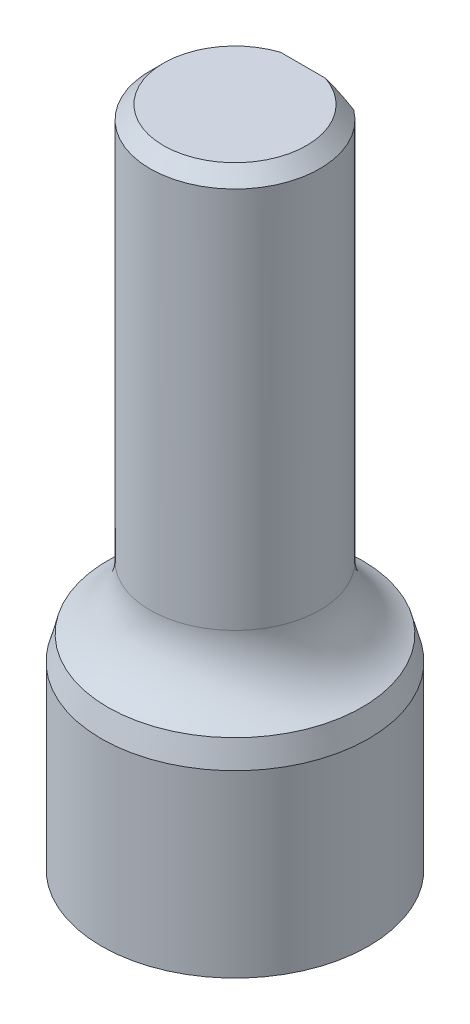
ISO-10303-21;
HEADER;
FILE_DESCRIPTION(('STEP AP214'),'2;1');
FILE_NAME('part.step','',(''),(''),'','','');
FILE_SCHEMA(('AUTOMOTIVE_DESIGN { 1 0 10303 214 1 1 1 1 }'));
ENDSEC;
DATA;
#1=APPLICATION_CONTEXT('core data for automotive mechanical design processes');
#2=APPLICATION_PROTOCOL_DEFINITION('international standard','automotive_design',2000,#1);
#3=PRODUCT_CONTEXT('',#1,'mechanical');
#4=PRODUCT('Part','Part','',(#3));
#5=PRODUCT_RELATED_PRODUCT_CATEGORY('part','',(#4));
#6=PRODUCT_DEFINITION_FORMATION('','',#4);
#7=PRODUCT_DEFINITION_CONTEXT('part definition',#1,'design');
#8=PRODUCT_DEFINITION('design','',#6,#7);
#9=PRODUCT_DEFINITION_SHAPE('','',#8);
#10=(LENGTH_UNIT() NAMED_UNIT(*) SI_UNIT(.MILLI.,.METRE.));
#11=(NAMED_UNIT(*) PLANE_ANGLE_UNIT() SI_UNIT($,.RADIAN.));
#12=(NAMED_UNIT(*) SI_UNIT($,.STERADIAN.) SOLID_ANGLE_UNIT());
#13=UNCERTAINTY_MEASURE_WITH_UNIT(LENGTH_MEASURE(1.E-05),#10,'distance_accuracy_value','');
#14=(GEOMETRIC_REPRESENTATION_CONTEXT(3) GLOBAL_UNCERTAINTY_ASSIGNED_CONTEXT((#13)) GLOBAL_UNIT_ASSIGNED_CONTEXT((#10,
#11,#12)) REPRESENTATION_CONTEXT('',''));
#15=CARTESIAN_POINT('',(0.,0.,0.));
#16=DIRECTION('',(0.,0.,1.));
#17=DIRECTION('',(1.,0.,0.));
#18=AXIS2_PLACEMENT_3D('',#15,#16,#17);
#19=CARTESIAN_POINT('',(0.,122.662819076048,0.));
#20=DIRECTION('',(0.,1.,0.));
#21=DIRECTION('',(0.,0.,1.));
#22=AXIS2_PLACEMENT_3D('',#19,#20,#21);
#23=CYLINDRICAL_SURFACE('',#22,6.35);
#24=CARTESIAN_POINT('',(0.,19.9468306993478,0.));
#25=DIRECTION('',(0.,-1.,0.));
#26=DIRECTION('',(0.,0.,-1.));
#27=AXIS2_PLACEMENT_3D('',#24,#25,#26);
#28=CIRCLE('',#27,6.35);
#29=CARTESIAN_POINT('',(0.,19.9468306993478,-6.35));
#30=VERTEX_POINT('',#29);
#31=EDGE_CURVE('E76',#30,#30,#28,.F.);
#32=ORIENTED_EDGE('',*,*,#31,.T.);
#33=EDGE_LOOP('',(#32));
#34=FACE_BOUND('',#33,.T.);
#35=CARTESIAN_POINT('',(0.,27.2034,0.));
#36=DIRECTION('',(0.,-1.,0.));
#37=DIRECTION('',(0.,0.,-1.));
#38=AXIS2_PLACEMENT_3D('',#35,#36,#37);
#39=CIRCLE('',#38,6.35);
#40=CARTESIAN_POINT('',(-3.81000000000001,27.2034,-5.08));
#41=VERTEX_POINT('',#40);
#42=CARTESIAN_POINT('',(3.81000000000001,27.2034,-5.08));
#43=VERTEX_POINT('',#42);
#44=EDGE_CURVE('E11',#41,#43,#39,.T.);
#45=ORIENTED_EDGE('',*,*,#44,.T.);
#46=DIRECTION('',(0.,1.,0.));
#47=VECTOR('',#46,1.);
#48=CARTESIAN_POINT('',(3.81000000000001,122.662819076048,-5.08));
#49=LINE('',#48,#47);
#50=CARTESIAN_POINT('',(3.81000000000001,48.5554,-5.08));
#51=VERTEX_POINT('',#50);
#52=EDGE_CURVE('E108',#43,#51,#49,.T.);
#53=ORIENTED_EDGE('',*,*,#52,.T.);
#54=CARTESIAN_POINT('',(0.,48.5554,0.));
#55=DIRECTION('',(0.,-1.,0.));
#56=DIRECTION('',(0.,0.,-1.));
#57=AXIS2_PLACEMENT_3D('',#54,#55,#56);
#58=CIRCLE('',#57,6.35);
#59=CARTESIAN_POINT('',(-3.81000000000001,48.5554,-5.08));
#60=VERTEX_POINT('',#59);
#61=EDGE_CURVE('E62',#51,#60,#58,.T.);
#62=ORIENTED_EDGE('',*,*,#61,.T.);
#63=DIRECTION('',(0.,1.,0.));
#64=VECTOR('',#63,1.);
#65=CARTESIAN_POINT('',(-3.81000000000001,122.662819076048,-5.08));
#66=LINE('',#65,#64);
#67=EDGE_CURVE('E38',#60,#41,#66,.F.);
#68=ORIENTED_EDGE('',*,*,#67,.T.);
#69=EDGE_LOOP('',(#45,#53,#62,#68));
#70=FACE_BOUND('',#69,.T.);
#71=ADVANCED_FACE('F17',(#34,#70),#23,.T.);
#72=CARTESIAN_POINT('',(0.,49.5554,0.));
#73=DIRECTION('',(0.,-1.,0.));
#74=DIRECTION('',(0.,0.,-1.));
#75=AXIS2_PLACEMENT_3D('',#72,#73,#74);
#76=PLANE('',#75);
#77=CARTESIAN_POINT('',(0.,49.5554,0.));
#78=DIRECTION('',(0.,-1.,0.));
#79=DIRECTION('',(0.,0.,-1.));
#80=AXIS2_PLACEMENT_3D('',#77,#78,#79);
#81=CIRCLE('',#80,5.34999999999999);
#82=CARTESIAN_POINT('',(-1.67812395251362,49.5554,-5.08));
#83=VERTEX_POINT('',#82);
#84=CARTESIAN_POINT('',(1.67812395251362,49.5554,-5.08));
#85=VERTEX_POINT('',#84);
#86=EDGE_CURVE('E58',#83,#85,#81,.F.);
#87=ORIENTED_EDGE('',*,*,#86,.T.);
#88=DIRECTION('',(1.,0.,0.));
#89=VECTOR('',#88,1.);
#90=CARTESIAN_POINT('',(6.63212456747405,49.5554,-5.08));
#91=LINE('',#90,#89);
#92=EDGE_CURVE('E32',#83,#85,#91,.T.);
#93=ORIENTED_EDGE('',*,*,#92,.F.);
#94=EDGE_LOOP('',(#87,#93));
#95=FACE_BOUND('',#94,.T.);
#96=ADVANCED_FACE('F57',(#95),#76,.F.);
#97=CARTESIAN_POINT('',(0.,0.,-10.00125));
#98=DIRECTION('',(0.,1.,0.));
#99=DIRECTION('',(0.,0.,1.));
#100=AXIS2_PLACEMENT_3D('',#97,#98,#99);
#101=PLANE('',#100);
#102=CARTESIAN_POINT('',(0.,0.,0.));
#103=DIRECTION('',(0.,1.,0.));
#104=DIRECTION('',(0.,0.,1.));
#105=AXIS2_PLACEMENT_3D('',#102,#103,#104);
#106=CIRCLE('',#105,10.00125);
#107=CARTESIAN_POINT('',(0.,0.,10.00125));
#108=VERTEX_POINT('',#107);
#109=EDGE_CURVE('E63',#108,#108,#106,.T.);
#110=ORIENTED_EDGE('',*,*,#109,.F.);
#111=EDGE_LOOP('',(#110));
#112=FACE_BOUND('',#111,.T.);
#113=ADVANCED_FACE('F93',(#112),#101,.F.);
#114=CARTESIAN_POINT('',(0.,122.662819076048,0.));
#115=DIRECTION('',(0.,1.,0.));
#116=DIRECTION('',(0.,0.,1.));
#117=AXIS2_PLACEMENT_3D('',#114,#115,#116);
#118=CYLINDRICAL_SURFACE('',#117,10.00125);
#119=CARTESIAN_POINT('',(0.,13.44,0.));
#120=DIRECTION('',(0.,-1.,0.));
#121=DIRECTION('',(0.,0.,-1.));
#122=AXIS2_PLACEMENT_3D('',#119,#120,#121);
#123=CIRCLE('',#122,10.00125);
#124=CARTESIAN_POINT('',(0.,13.44,-10.00125));
#125=VERTEX_POINT('',#124);
#126=EDGE_CURVE('E73',#125,#125,#123,.T.);
#127=ORIENTED_EDGE('',*,*,#126,.T.);
#128=EDGE_LOOP('',(#127));
#129=FACE_BOUND('',#128,.T.);
#130=ORIENTED_EDGE('',*,*,#109,.T.);
#131=EDGE_LOOP('',(#130));
#132=FACE_BOUND('',#131,.T.);
#133=ADVANCED_FACE('F90',(#129,#132),#118,.T.);
#134=CARTESIAN_POINT('',(0.,49.5554,0.));
#135=DIRECTION('',(0.,-1.,0.));
#136=DIRECTION('',(0.,0.,-1.));
#137=AXIS2_PLACEMENT_3D('',#134,#135,#136);
#138=CONICAL_SURFACE('',#137,5.35,0.78539816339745);
#139=CARTESIAN_POINT('',(-13.0391577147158,40.9116144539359,-5.08));
#140=CARTESIAN_POINT('',(-12.8399065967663,41.0972697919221,-5.08));
#141=CARTESIAN_POINT('',(-12.640379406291,41.2826287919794,-5.08));
#142=CARTESIAN_POINT('',(-12.2406872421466,41.6526604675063,-5.08));
#143=CARTESIAN_POINT('',(-12.0405222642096,41.8373331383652,-5.08));
#144=CARTESIAN_POINT('',(-11.4388571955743,42.3902592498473,-5.08));
#145=CARTESIAN_POINT('',(-11.0362753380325,42.757338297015,-5.08));
#146=CARTESIAN_POINT('',(-10.2245874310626,43.4897208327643,-5.08));
#147=CARTESIAN_POINT('',(-9.81545574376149,43.8549959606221,-5.08));
#148=CARTESIAN_POINT('',(-8.99197512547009,44.5795308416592,-5.08));
#149=CARTESIAN_POINT('',(-8.57762687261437,44.9387913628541,-5.08));
#150=CARTESIAN_POINT('',(-7.82501336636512,45.5777019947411,-5.08));
#151=CARTESIAN_POINT('',(-7.4880844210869,45.858918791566,-5.08));
#152=CARTESIAN_POINT('',(-6.97779605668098,46.2748496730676,-5.08));
#153=CARTESIAN_POINT('',(-6.80685682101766,46.4125321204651,-5.08));
#154=CARTESIAN_POINT('',(-6.46307528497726,46.6854973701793,-5.08));
#155=CARTESIAN_POINT('',(-6.29023302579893,46.8207802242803,-5.08));
#156=CARTESIAN_POINT('',(-5.94256200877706,47.0882313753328,-5.08));
#157=CARTESIAN_POINT('',(-5.76773660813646,47.2204040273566,-5.08));
#158=CARTESIAN_POINT('',(-5.41543643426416,47.4811617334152,-5.08));
#159=CARTESIAN_POINT('',(-5.23796179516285,47.6097469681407,-5.08));
#160=CARTESIAN_POINT('',(-4.87992627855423,47.8623899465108,-5.08));
#161=CARTESIAN_POINT('',(-4.69936681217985,47.9864496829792,-5.08));
#162=CARTESIAN_POINT('',(-4.33449456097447,48.2289006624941,-5.08));
#163=CARTESIAN_POINT('',(-4.15018227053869,48.3472926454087,-5.08));
#164=CARTESIAN_POINT('',(-3.7947752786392,48.5659202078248,-5.08));
#165=CARTESIAN_POINT('',(-3.6240864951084,48.6668125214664,-5.08));
#166=CARTESIAN_POINT('',(-3.2784185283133,48.861065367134,-5.08));
#167=CARTESIAN_POINT('',(-3.103438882,48.9544250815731,-5.08));
#168=CARTESIAN_POINT('',(-2.74870338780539,49.1314796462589,-5.08));
#169=CARTESIAN_POINT('',(-2.56894952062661,49.2151784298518,-5.08));
#170=CARTESIAN_POINT('',(-2.20418117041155,49.370276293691,-5.08));
#171=CARTESIAN_POINT('',(-2.0191680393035,49.4416785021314,-5.08));
#172=CARTESIAN_POINT('',(-1.68300595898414,49.5556888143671,-5.08));
#173=CARTESIAN_POINT('',(-1.53284635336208,49.6011963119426,-5.08));
#174=CARTESIAN_POINT('',(-1.22954082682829,49.6807679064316,-5.08));
#175=CARTESIAN_POINT('',(-1.07639602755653,49.7148362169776,-5.08));
#176=CARTESIAN_POINT('',(-0.768253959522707,49.7698641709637,-5.08));
#177=CARTESIAN_POINT('',(-0.613264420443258,49.790866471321,-5.08));
#178=CARTESIAN_POINT('',(-0.302010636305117,49.8187900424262,-5.08));
#179=CARTESIAN_POINT('',(-0.145746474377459,49.8257122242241,-5.08));
#180=CARTESIAN_POINT('',(0.167270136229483,49.8250649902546,-5.08));
#181=CARTESIAN_POINT('',(0.324022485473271,49.8174474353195,-5.08));
#182=CARTESIAN_POINT('',(0.636186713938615,49.7880793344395,-5.08));
#183=CARTESIAN_POINT('',(0.791598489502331,49.7663277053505,-5.08));
#184=CARTESIAN_POINT('',(1.10050424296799,49.7097902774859,-5.08));
#185=CARTESIAN_POINT('',(1.25399061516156,49.6749635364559,-5.08));
#186=CARTESIAN_POINT('',(1.55788964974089,49.593907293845,-5.08));
#187=CARTESIAN_POINT('',(1.70830213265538,49.5476771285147,-5.08));
#188=CARTESIAN_POINT('',(2.01952469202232,49.4408253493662,-5.08));
#189=CARTESIAN_POINT('',(2.18001077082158,49.3792684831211,-5.08));
#190=CARTESIAN_POINT('',(2.49704038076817,49.2467021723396,-5.08));
#191=CARTESIAN_POINT('',(2.65358274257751,49.1756899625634,-5.08));
#192=CARTESIAN_POINT('',(2.96320046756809,49.0258958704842,-5.08));
#193=CARTESIAN_POINT('',(3.11626957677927,48.9471011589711,-5.08));
#194=CARTESIAN_POINT('',(3.41901366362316,48.7833210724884,-5.08));
#195=CARTESIAN_POINT('',(3.56868905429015,48.6983364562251,-5.08));
#196=CARTESIAN_POINT('',(3.86697396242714,48.5222021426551,-5.08));
#197=CARTESIAN_POINT('',(4.01554456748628,48.4309868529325,-5.08));
#198=CARTESIAN_POINT('',(4.3100115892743,48.24434645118,-5.08));
#199=CARTESIAN_POINT('',(4.455907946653,48.1489212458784,-5.08));
#200=CARTESIAN_POINT('',(4.74523366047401,47.9547052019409,-5.08));
#201=CARTESIAN_POINT('',(4.88866524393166,47.8559176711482,-5.08));
#202=CARTESIAN_POINT('',(5.17350642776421,47.6554802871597,-5.08));
#203=CARTESIAN_POINT('',(5.31491605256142,47.5538304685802,-5.08));
#204=CARTESIAN_POINT('',(5.6293723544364,47.3237004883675,-5.08));
#205=CARTESIAN_POINT('',(5.80195283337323,47.1945839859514,-5.08));
#206=CARTESIAN_POINT('',(6.14484691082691,46.933371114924,-5.08));
#207=CARTESIAN_POINT('',(6.315160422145,46.8012746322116,-5.08));
#208=CARTESIAN_POINT('',(6.82327324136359,46.4013072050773,-5.08));
#209=CARTESIAN_POINT('',(7.1582019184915,46.1297901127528,-5.08));
#210=CARTESIAN_POINT('',(7.82279934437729,45.5797392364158,-5.08));
#211=CARTESIAN_POINT('',(8.152462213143,45.3011983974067,-5.08));
#212=CARTESIAN_POINT('',(8.80758158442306,44.7392023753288,-5.08));
#213=CARTESIAN_POINT('',(9.13303795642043,44.4557470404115,-5.08));
#214=CARTESIAN_POINT('',(9.76004979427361,43.9033802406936,-5.08));
#215=CARTESIAN_POINT('',(10.0618050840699,43.6346950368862,-5.08));
#216=CARTESIAN_POINT('',(10.6630708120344,43.0948120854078,-5.08));
#217=CARTESIAN_POINT('',(10.9625811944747,42.8236142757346,-5.08));
#218=CARTESIAN_POINT('',(11.5591152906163,42.2798505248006,-5.08));
#219=CARTESIAN_POINT('',(11.8561430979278,42.0072890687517,-5.08));
#220=CARTESIAN_POINT('',(12.448695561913,41.4605653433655,-5.08));
#221=CARTESIAN_POINT('',(12.7442202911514,41.1864031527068,-5.08));
#222=CARTESIAN_POINT('',(13.0391577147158,40.9116144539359,-5.08));
#223=B_SPLINE_CURVE_WITH_KNOTS('',3,(#139,#140,#141,#142,#143,#144,#145,#146,#147,#148,#149,
#150,#151,#152,#153,#154,#155,#156,#157,#158,#159,#160,#161,#162,#163,#164,#165,#166,#167,#168,
#169,#170,#171,#172,#173,#174,#175,#176,#177,#178,#179,#180,#181,#182,#183,#184,#185,#186,#187,
#188,#189,#190,#191,#192,#193,#194,#195,#196,#197,#198,#199,#200,#201,#202,#203,#204,#205,#206,
#207,#208,#209,#210,#211,#212,#213,#214,#215,#216,#217,#218,#219,#220,#221,#222),.UNSPECIFIED.,
.F.,.F.,(4,2,2,2,2,2,2,2,2,2,2,2,2,2,2,2,2,2,2,2,2,2,2,2,2,2,2,2,2,2,2,2,2,2,2,2,2,2,2,2,2,4),
(0.,0.817018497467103,1.63404247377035,3.26845308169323,4.91381089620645,6.55895698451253,
7.87546001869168,8.53391883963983,9.19236343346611,9.84982336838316,10.507250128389,
11.1643838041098,11.8214314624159,12.4161147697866,13.0108625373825,13.6053672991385,
14.1997205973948,14.6700539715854,15.1402139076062,15.6088307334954,16.077417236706,
16.5475578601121,17.0177345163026,17.4893958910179,17.9610847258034,18.4763725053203,
18.9918113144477,19.5081144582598,20.0243544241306,20.547280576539,21.0702183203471,
21.5926556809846,22.1150867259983,22.761648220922,23.4082345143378,24.7015673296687,
25.9962555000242,27.2909837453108,28.5030860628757,29.7152183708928,30.9246074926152,
32.1339376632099),.UNSPECIFIED.);
#224=EDGE_CURVE('E25',#60,#83,#223,.T.);
#225=ORIENTED_EDGE('',*,*,#224,.F.);
#226=ORIENTED_EDGE('',*,*,#61,.F.);
#227=EDGE_CURVE('E54',#85,#51,#223,.T.);
#228=ORIENTED_EDGE('',*,*,#227,.F.);
#229=ORIENTED_EDGE('',*,*,#86,.F.);
#230=EDGE_LOOP('',(#225,#226,#228,#229));
#231=FACE_BOUND('',#230,.T.);
#232=ADVANCED_FACE('F61',(#231),#138,.T.);
#233=CARTESIAN_POINT('',(0.,15.24,0.));
#234=DIRECTION('',(0.,-1.,0.));
#235=DIRECTION('',(0.,0.,-1.));
#236=AXIS2_PLACEMENT_3D('',#233,#234,#235);
#237=CONICAL_SURFACE('',#236,9.51894145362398,0.261799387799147);
#238=CARTESIAN_POINT('',(0.,15.24,0.));
#239=DIRECTION('',(0.,-1.,0.));
#240=DIRECTION('',(0.,0.,-1.));
#241=AXIS2_PLACEMENT_3D('',#238,#239,#240);
#242=CIRCLE('',#241,9.51894145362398);
#243=CARTESIAN_POINT('',(0.,15.24,-9.51894145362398));
#244=VERTEX_POINT('',#243);
#245=EDGE_CURVE('E65',#244,#244,#242,.F.);
#246=CARTESIAN_POINT('',(0.,13.44,-10.00125));
#247=CARTESIAN_POINT('',(0.,13.45875,-9.99622595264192));
#248=CARTESIAN_POINT('',(0.,13.4775,-9.99120190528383));
#249=CARTESIAN_POINT('',(0.,13.515,-9.98115381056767));
#250=CARTESIAN_POINT('',(0.,13.53375,-9.97612976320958));
#251=CARTESIAN_POINT('',(0.,13.57125,-9.96608166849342));
#252=CARTESIAN_POINT('',(0.,13.59,-9.96105762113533));
#253=CARTESIAN_POINT('',(0.,13.6275,-9.95100952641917));
#254=CARTESIAN_POINT('',(0.,13.64625,-9.94598547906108));
#255=CARTESIAN_POINT('',(0.,13.68375,-9.93593738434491));
#256=CARTESIAN_POINT('',(0.,13.7025,-9.93091333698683));
#257=CARTESIAN_POINT('',(0.,13.74,-9.92086524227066));
#258=CARTESIAN_POINT('',(0.,13.75875,-9.91584119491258));
#259=CARTESIAN_POINT('',(0.,13.79625,-9.90579310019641));
#260=CARTESIAN_POINT('',(0.,13.815,-9.90076905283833));
#261=CARTESIAN_POINT('',(0.,13.8525,-9.89072095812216));
#262=CARTESIAN_POINT('',(0.,13.87125,-9.88569691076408));
#263=CARTESIAN_POINT('',(0.,13.90875,-9.87564881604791));
#264=CARTESIAN_POINT('',(0.,13.9275,-9.87062476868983));
#265=CARTESIAN_POINT('',(0.,13.965,-9.86057667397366));
#266=CARTESIAN_POINT('',(0.,13.98375,-9.85555262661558));
#267=CARTESIAN_POINT('',(0.,14.02125,-9.84550453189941));
#268=CARTESIAN_POINT('',(0.,14.04,-9.84048048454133));
#269=CARTESIAN_POINT('',(0.,14.0775,-9.83043238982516));
#270=CARTESIAN_POINT('',(0.,14.09625,-9.82540834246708));
#271=CARTESIAN_POINT('',(0.,14.13375,-9.81536024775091));
#272=CARTESIAN_POINT('',(0.,14.1525,-9.81033620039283));
#273=CARTESIAN_POINT('',(0.,14.19,-9.80028810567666));
#274=CARTESIAN_POINT('',(0.,14.20875,-9.79526405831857));
#275=CARTESIAN_POINT('',(0.,14.24625,-9.78521596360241));
#276=CARTESIAN_POINT('',(0.,14.265,-9.78019191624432));
#277=CARTESIAN_POINT('',(0.,14.3025,-9.77014382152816));
#278=CARTESIAN_POINT('',(0.,14.32125,-9.76511977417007));
#279=CARTESIAN_POINT('',(0.,14.35875,-9.75507167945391));
#280=CARTESIAN_POINT('',(0.,14.3775,-9.75004763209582));
#281=CARTESIAN_POINT('',(0.,14.415,-9.73999953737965));
#282=CARTESIAN_POINT('',(0.,14.43375,-9.73497549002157));
#283=CARTESIAN_POINT('',(0.,14.47125,-9.7249273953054));
#284=CARTESIAN_POINT('',(0.,14.49,-9.71990334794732));
#285=CARTESIAN_POINT('',(0.,14.5275,-9.70985525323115));
#286=CARTESIAN_POINT('',(0.,14.54625,-9.70483120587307));
#287=CARTESIAN_POINT('',(0.,14.58375,-9.6947831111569));
#288=CARTESIAN_POINT('',(0.,14.6025,-9.68975906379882));
#289=CARTESIAN_POINT('',(0.,14.64,-9.67971096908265));
#290=CARTESIAN_POINT('',(0.,14.65875,-9.67468692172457));
#291=CARTESIAN_POINT('',(0.,14.69625,-9.6646388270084));
#292=CARTESIAN_POINT('',(0.,14.715,-9.65961477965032));
#293=CARTESIAN_POINT('',(0.,14.7525,-9.64956668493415));
#294=CARTESIAN_POINT('',(0.,14.77125,-9.64454263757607));
#295=CARTESIAN_POINT('',(0.,14.80875,-9.6344945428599));
#296=CARTESIAN_POINT('',(0.,14.8275,-9.62947049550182));
#297=CARTESIAN_POINT('',(0.,14.865,-9.61942240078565));
#298=CARTESIAN_POINT('',(0.,14.88375,-9.61439835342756));
#299=CARTESIAN_POINT('',(0.,14.92125,-9.6043502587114));
#300=CARTESIAN_POINT('',(0.,14.94,-9.59932621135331));
#301=CARTESIAN_POINT('',(0.,14.9775,-9.58927811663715));
#302=CARTESIAN_POINT('',(0.,14.99625,-9.58425406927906));
#303=CARTESIAN_POINT('',(0.,15.03375,-9.5742059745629));
#304=CARTESIAN_POINT('',(0.,15.0525,-9.56918192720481));
#305=CARTESIAN_POINT('',(0.,15.09,-9.55913383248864));
#306=CARTESIAN_POINT('',(0.,15.10875,-9.55410978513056));
#307=CARTESIAN_POINT('',(0.,15.14625,-9.54406169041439));
#308=CARTESIAN_POINT('',(0.,15.165,-9.53903764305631));
#309=CARTESIAN_POINT('',(0.,15.2025,-9.52898954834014));
#310=CARTESIAN_POINT('',(0.,15.22125,-9.52396550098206));
#311=CARTESIAN_POINT('',(0.,15.24,-9.51894145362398));
#312=B_SPLINE_CURVE_WITH_KNOTS('',3,(#246,#247,#248,#249,#250,#251,#252,#253,#254,#255,#256,
#257,#258,#259,#260,#261,#262,#263,#264,#265,#266,#267,#268,#269,#270,#271,#272,#273,#274,#275,
#276,#277,#278,#279,#280,#281,#282,#283,#284,#285,#286,#287,#288,#289,#290,#291,#292,#293,#294,
#295,#296,#297,#298,#299,#300,#301,#302,#303,#304,#305,#306,#307,#308,#309,#310,#311),
.UNSPECIFIED.,.F.,.F.,(4,2,2,2,2,2,2,2,2,2,2,2,2,2,2,2,2,2,2,2,2,2,2,2,2,2,2,2,2,2,2,2,4),(0.,
0.0582342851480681,0.116468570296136,0.174702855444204,0.232937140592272,0.29117142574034,
0.349405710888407,0.407639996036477,0.465874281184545,0.524108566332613,0.582342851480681,
0.640577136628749,0.698811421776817,0.757045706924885,0.815279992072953,0.87351427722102,
0.93174856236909,0.989982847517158,1.04821713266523,1.10645141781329,1.16468570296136,
1.22291998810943,1.2811542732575,1.33938855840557,1.39762284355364,1.4558571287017,
1.51409141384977,1.57232569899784,1.63055998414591,1.68879426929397,1.74702855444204,
1.80526283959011,1.86349712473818),.UNSPECIFIED.);
#313=EDGE_CURVE('BSEAM118',#125,#244,#312,.T.);
#314=ORIENTED_EDGE('',*,*,#126,.F.);
#315=ORIENTED_EDGE('',*,*,#245,.F.);
#316=ORIENTED_EDGE('',*,*,#313,.T.);
#317=ORIENTED_EDGE('',*,*,#313,.F.);
#318=EDGE_LOOP('',(#314,#316,#315,#317));
#319=FACE_BOUND('',#318,.T.);
#320=ADVANCED_FACE('F118',(#319),#237,.T.);
#321=CARTESIAN_POINT('',(0.,19.9468306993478,0.));
#322=DIRECTION('',(0.,-1.,0.));
#323=DIRECTION('',(0.,0.,-1.));
#324=AXIS2_PLACEMENT_3D('',#321,#322,#323);
#325=TOROIDAL_SURFACE('',#324,11.43,5.08);
#326=ORIENTED_EDGE('',*,*,#245,.T.);
#327=EDGE_LOOP('',(#326));
#328=FACE_BOUND('',#327,.T.);
#329=ORIENTED_EDGE('',*,*,#31,.F.);
#330=EDGE_LOOP('',(#329));
#331=FACE_BOUND('',#330,.T.);
#332=ADVANCED_FACE('F19',(#328,#331),#325,.F.);
#333=CARTESIAN_POINT('',(6.63212456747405,27.2034,-5.08));
#334=DIRECTION('',(0.,-1.,0.));
#335=DIRECTION('',(0.,0.,-1.));
#336=AXIS2_PLACEMENT_3D('',#333,#334,#335);
#337=PLANE('',#336);
#338=DIRECTION('',(1.,0.,0.));
#339=VECTOR('',#338,1.);
#340=CARTESIAN_POINT('',(6.63212456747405,27.2034,-5.08));
#341=LINE('',#340,#339);
#342=EDGE_CURVE('E59',#41,#43,#341,.T.);
#343=ORIENTED_EDGE('',*,*,#342,.T.);
#344=ORIENTED_EDGE('',*,*,#44,.F.);
#345=EDGE_LOOP('',(#343,#344));
#346=FACE_BOUND('',#345,.T.);
#347=ADVANCED_FACE('F89',(#346),#337,.F.);
#348=CARTESIAN_POINT('',(6.63212456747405,27.2034,-5.08));
#349=DIRECTION('',(0.,0.,1.));
#350=DIRECTION('',(1.,0.,0.));
#351=AXIS2_PLACEMENT_3D('',#348,#349,#350);
#352=PLANE('',#351);
#353=ORIENTED_EDGE('',*,*,#224,.T.);
#354=ORIENTED_EDGE('',*,*,#92,.T.);
#355=ORIENTED_EDGE('',*,*,#227,.T.);
#356=ORIENTED_EDGE('',*,*,#52,.F.);
#357=ORIENTED_EDGE('',*,*,#342,.F.);
#358=ORIENTED_EDGE('',*,*,#67,.F.);
#359=EDGE_LOOP('',(#353,#354,#355,#356,#357,#358));
#360=FACE_BOUND('',#359,.T.);
#361=ADVANCED_FACE('F49',(#360),#352,.F.);
#362=CLOSED_SHELL('',(#71,#96,#113,#133,#232,#320,#332,#347,#361));
#363=MANIFOLD_SOLID_BREP('B1',#362);
#364=ADVANCED_BREP_SHAPE_REPRESENTATION('',(#18,#363),#14);
#365=SHAPE_DEFINITION_REPRESENTATION(#9,#364);
ENDSEC;
END-ISO-10303-21;
